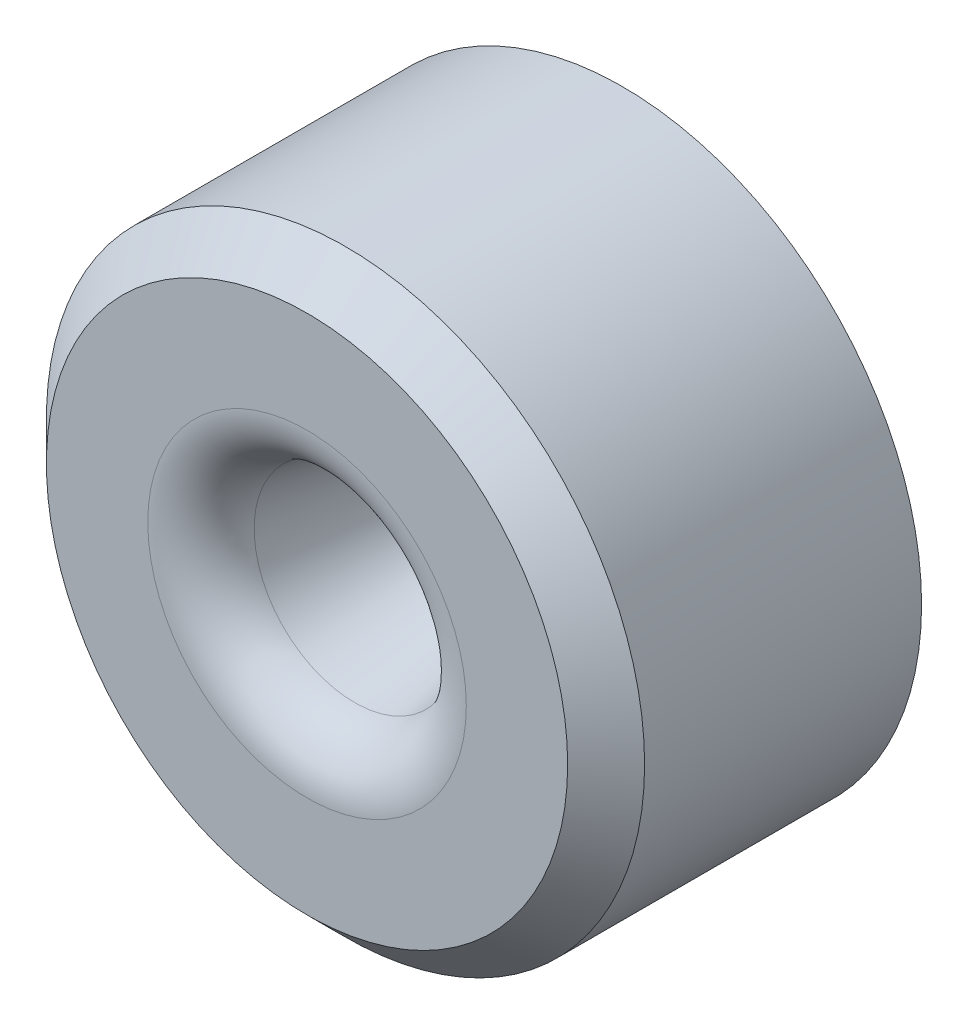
from build123d import *


with BuildPart() as part:
    # Sketch 1 → Revolve 1 (revolve)
    with BuildSketch(Plane(origin=(0, 0, 0), x_dir=(0, 0, -1), z_dir=(1, 0, 0)), mode=Mode.PRIVATE) as revolve_1_sk:
        with BuildLine():
            Line((0, 2.103266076), (0, 3.4417))
            Line((0, 3.4417), (0.508, 3.9497))
            Line((0.508, 3.9497), (4.1656, 3.9497))
            Line((4.1656, 3.9497), (4.1656, 0.9779))
            Line((4.1656, 0.9779), (2.270454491, 0.9779))
            Line((2.270454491, 0.9779), (0.628720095, 1.326861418))
            ThreePointArc((0.628720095, 1.326861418), (0.176890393, 1.603743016), (0, 2.103266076))
        make_face()
    revolve(revolve_1_sk.sketch.rotate(Axis((0, 0, 0), (0, 0, -1)), 90), axis=Axis((0, 0, 0), (0, 0, -1)))


solid = part.part
